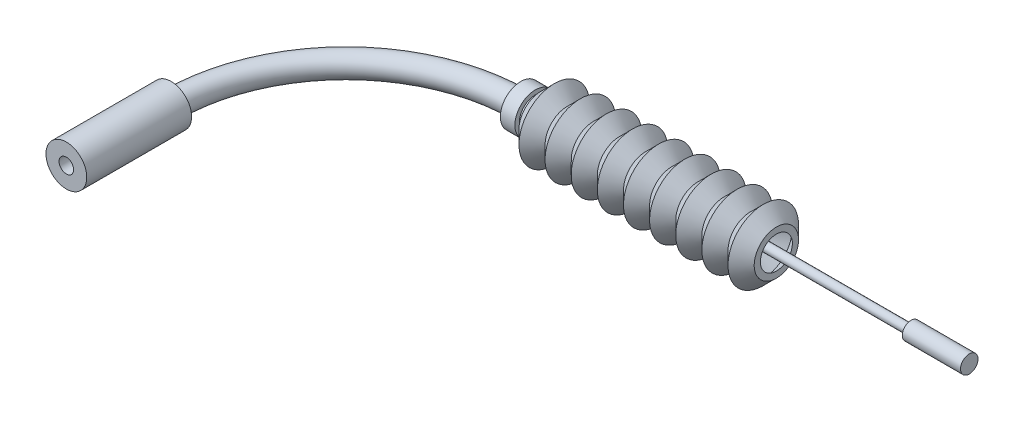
from build123d import *

# Parameters (mm, degrees)
SCHIZZO2_R        = 2
SCHIZZO2_R_2      = 1.25
SCHIZZO3_R        = 3.5
SCHIZZO3_R_2      = 1.25
ESTRUSIONE1_DEPTH = 18
SCHIZZO4_R        = 3.5
SCHIZZO4_R_2      = 1.25
ESTRUSIONE2_DEPTH = 2.5
SCHIZZO5_R        = 2.75
SCHIZZO5_R_2      = 1.25
ESTRUSIONE3_DEPTH = 4.5
SCHIZZO8_R        = 0.75
ESTRUSIONE4_DEPTH = 70
SCHIZZO9_R        = 1.5
ESTRUSIONE5_DEPTH = 10


with BuildPart() as part:
    # Sweep1: sweep along a path in Schizzo1
    with BuildLine(Plane(origin=(0, 0, 0), x_dir=(1, 0, 0), z_dir=(0, 1, 0))) as sweep1_path:
        ThreePointArc((0, 30), (-21.213203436, 21.213203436), (-30, 0))
    # Schizzo2 → Sweep1 (sweep)
    with BuildSketch(Plane.XY):
        with Locations((-30, 0)):
            Circle(SCHIZZO2_R)
        with Locations((-30, 0)):
            Circle(SCHIZZO2_R_2, mode=Mode.SUBTRACT)
    sweep(path=sweep1_path.line)

    # Schizzo3 → Estrusione1 (add)
    with BuildSketch(Plane.XY):
        with Locations((-30, 0)):
            Circle(SCHIZZO3_R)
        with Locations(Location((-30, 0, 0), (0, 0, 180))):
            Circle(SCHIZZO3_R_2, mode=Mode.SUBTRACT)
    extrude(amount=ESTRUSIONE1_DEPTH)

    # Schizzo4 → Estrusione2 (add)
    with BuildSketch(Plane(origin=(0, 0, 0), x_dir=(0, 0, -1), z_dir=(1, 0, 0))):
        with Locations((30, 0)):
            Circle(SCHIZZO4_R)
        with Locations((30, 0)):
            Circle(SCHIZZO4_R_2, mode=Mode.SUBTRACT)
    extrude(amount=ESTRUSIONE2_DEPTH)

    # Schizzo5 → Estrusione3 (add)
    with BuildSketch(Plane(origin=(2.5, 0, 0), x_dir=(0, 0, -1), z_dir=(1, 0, 0))):
        with Locations((30, 0)):
            Circle(SCHIZZO5_R)
        with Locations((30, 0)):
            Circle(SCHIZZO5_R_2, mode=Mode.SUBTRACT)
    extrude(amount=ESTRUSIONE3_DEPTH)


with BuildPart() as body_2:
    # Schizzo7 → Rivoluzione1 (revolve)
    with BuildSketch(Plane.XY.offset(-30), mode=Mode.PRIVATE) as rivoluzione1_sk:
        Polygon((3.5, 2.75), (5.75, 4.99271539), (8, 2.75), (10.235454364, 4.99271539), (12.485454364, 2.75), (14.720908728, 4.99271539), (16.970908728, 2.75), (19.206363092, 4.99271539), (21.456363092, 2.75), (23.691817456, 4.99271539), (25.943537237, 2.748285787), (28.178991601, 4.991001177), (30.428991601, 2.748285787), (32.664445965, 4.991001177), (34.914445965, 2.748285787), (37.149900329, 4.991001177), (39.40162011, 2.746571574), (41.637074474, 4.989286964), (43.887074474, 2.746571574), (43.887074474, 3.805516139), (41.635354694, 6.049945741), (39.399900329, 3.807230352), (37.148180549, 6.051659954), (34.912726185, 3.808944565), (32.662726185, 6.051659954), (30.42727182, 3.808944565), (28.17727182, 6.051659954), (25.941817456, 3.808944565), (23.690097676, 6.053374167), (21.454643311, 3.810658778), (19.204643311, 6.053374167), (16.969188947, 3.810658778), (14.719188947, 6.053374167), (12.483734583, 3.810658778), (10.233734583, 6.053374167), (7.998280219, 3.810658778), (5.75, 6.051659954), (3.5, 3.808944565), align=None)
    revolve(rivoluzione1_sk.sketch.rotate(Axis((7, 0, -30), (-1, 0, 0)), 90), axis=Axis((7, 0, -30), (-1, 0, 0)))


with BuildPart() as body_3:
    # Schizzo8 → Estrusione4 (new body)
    with BuildSketch(Plane(origin=(7, 0, 0), x_dir=(0, 0, -1), z_dir=(1, 0, 0))):
        with Locations((30, 0)):
            Circle(SCHIZZO8_R)
    extrude(amount=ESTRUSIONE4_DEPTH)

    # Schizzo9 → Estrusione5 (add)
    with BuildSketch(Plane(origin=(77, 0, 0), x_dir=(0, 0, -1), z_dir=(1, 0, 0))):
        with Locations((30, 0)):
            Circle(SCHIZZO9_R)
    extrude(amount=-ESTRUSIONE5_DEPTH)


solid = Compound([part.part, body_2.part, body_3.part])
